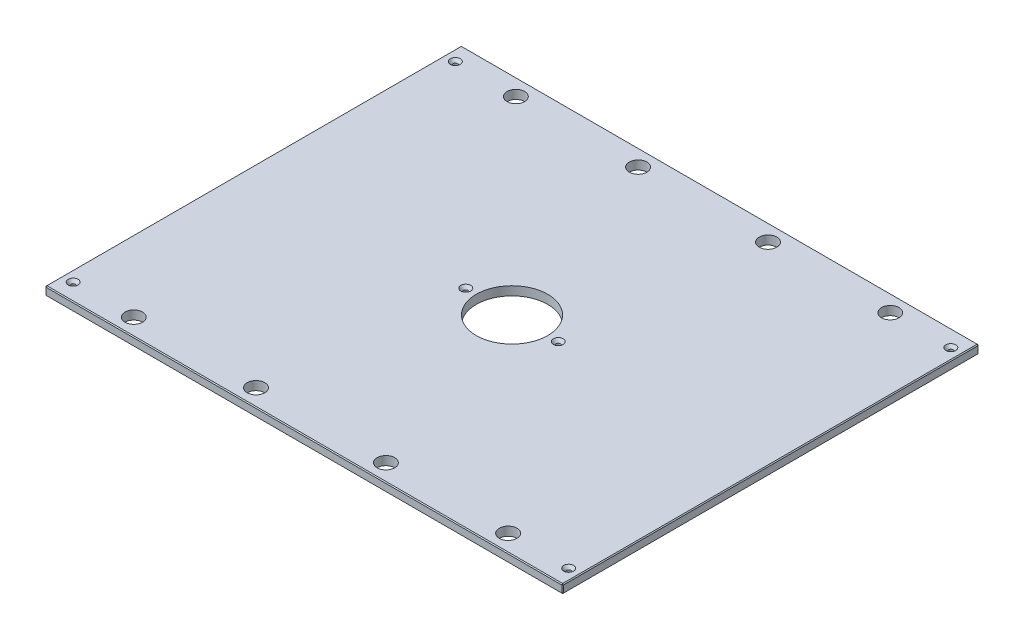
ISO-10303-21;
HEADER;
FILE_DESCRIPTION(('STEP AP214'),'2;1');
FILE_NAME('part.step','',(''),(''),'','','');
FILE_SCHEMA(('AUTOMOTIVE_DESIGN { 1 0 10303 214 1 1 1 1 }'));
ENDSEC;
DATA;
#1=APPLICATION_CONTEXT('core data for automotive mechanical design processes');
#2=APPLICATION_PROTOCOL_DEFINITION('international standard','automotive_design',2000,#1);
#3=PRODUCT_CONTEXT('',#1,'mechanical');
#4=PRODUCT('Part','Part','',(#3));
#5=PRODUCT_RELATED_PRODUCT_CATEGORY('part','',(#4));
#6=PRODUCT_DEFINITION_FORMATION('','',#4);
#7=PRODUCT_DEFINITION_CONTEXT('part definition',#1,'design');
#8=PRODUCT_DEFINITION('design','',#6,#7);
#9=PRODUCT_DEFINITION_SHAPE('','',#8);
#10=(LENGTH_UNIT() NAMED_UNIT(*) SI_UNIT(.MILLI.,.METRE.));
#11=(NAMED_UNIT(*) PLANE_ANGLE_UNIT() SI_UNIT($,.RADIAN.));
#12=(NAMED_UNIT(*) SI_UNIT($,.STERADIAN.) SOLID_ANGLE_UNIT());
#13=UNCERTAINTY_MEASURE_WITH_UNIT(LENGTH_MEASURE(1.E-05),#10,'distance_accuracy_value','');
#14=(GEOMETRIC_REPRESENTATION_CONTEXT(3) GLOBAL_UNCERTAINTY_ASSIGNED_CONTEXT((#13)) GLOBAL_UNIT_ASSIGNED_CONTEXT((#10,
#11,#12)) REPRESENTATION_CONTEXT('',''));
#15=CARTESIAN_POINT('',(0.,0.,0.));
#16=DIRECTION('',(0.,0.,1.));
#17=DIRECTION('',(1.,0.,0.));
#18=AXIS2_PLACEMENT_3D('',#15,#16,#17);
#19=CARTESIAN_POINT('',(-373.0625,12.7,-300.0375));
#20=DIRECTION('',(1.,0.,0.));
#21=DIRECTION('',(0.,0.,-1.));
#22=AXIS2_PLACEMENT_3D('',#19,#20,#21);
#23=PLANE('',#22);
#24=DIRECTION('',(0.,0.,-1.));
#25=VECTOR('',#24,1.);
#26=CARTESIAN_POINT('',(-373.0625,11.4299999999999,-300.0375));
#27=LINE('',#26,#25);
#28=CARTESIAN_POINT('',(-373.0625,11.4299999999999,298.7675));
#29=VERTEX_POINT('',#28);
#30=CARTESIAN_POINT('',(-373.0625,11.4299999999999,-298.7675));
#31=VERTEX_POINT('',#30);
#32=EDGE_CURVE('E135',#29,#31,#27,.T.);
#33=ORIENTED_EDGE('',*,*,#32,.T.);
#34=DIRECTION('',(0.,-1.,0.));
#35=VECTOR('',#34,1.);
#36=CARTESIAN_POINT('',(-373.0625,12.7,-298.7675));
#37=LINE('',#36,#35);
#38=CARTESIAN_POINT('',(-373.0625,1.2700000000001,-298.7675));
#39=VERTEX_POINT('',#38);
#40=EDGE_CURVE('E131',#31,#39,#37,.T.);
#41=ORIENTED_EDGE('',*,*,#40,.T.);
#42=DIRECTION('',(0.,0.,1.));
#43=VECTOR('',#42,1.);
#44=CARTESIAN_POINT('',(-373.0625,1.2700000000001,-300.0375));
#45=LINE('',#44,#43);
#46=CARTESIAN_POINT('',(-373.0625,1.2700000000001,298.7675));
#47=VERTEX_POINT('',#46);
#48=EDGE_CURVE('E126',#39,#47,#45,.T.);
#49=ORIENTED_EDGE('',*,*,#48,.T.);
#50=DIRECTION('',(0.,1.,0.));
#51=VECTOR('',#50,1.);
#52=CARTESIAN_POINT('',(-373.0625,12.7,298.7675));
#53=LINE('',#52,#51);
#54=EDGE_CURVE('E128',#47,#29,#53,.T.);
#55=ORIENTED_EDGE('',*,*,#54,.T.);
#56=EDGE_LOOP('',(#33,#41,#49,#55));
#57=FACE_BOUND('',#56,.T.);
#58=ADVANCED_FACE('F35',(#57),#23,.F.);
#59=CARTESIAN_POINT('',(-373.0625,12.7,300.0375));
#60=DIRECTION('',(0.,0.,-1.));
#61=DIRECTION('',(-1.,0.,0.));
#62=AXIS2_PLACEMENT_3D('',#59,#60,#61);
#63=PLANE('',#62);
#64=DIRECTION('',(1.,0.,0.));
#65=VECTOR('',#64,1.);
#66=CARTESIAN_POINT('',(-373.0625,1.2700000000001,300.0375));
#67=LINE('',#66,#65);
#68=CARTESIAN_POINT('',(-371.7925,1.2700000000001,300.0375));
#69=VERTEX_POINT('',#68);
#70=CARTESIAN_POINT('',(371.7925,1.2700000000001,300.0375));
#71=VERTEX_POINT('',#70);
#72=EDGE_CURVE('E58',#69,#71,#67,.T.);
#73=ORIENTED_EDGE('',*,*,#72,.T.);
#74=DIRECTION('',(0.,1.,0.));
#75=VECTOR('',#74,1.);
#76=CARTESIAN_POINT('',(371.7925,12.7,300.0375));
#77=LINE('',#76,#75);
#78=CARTESIAN_POINT('',(371.7925,11.4299999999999,300.0375));
#79=VERTEX_POINT('',#78);
#80=EDGE_CURVE('E11',#71,#79,#77,.T.);
#81=ORIENTED_EDGE('',*,*,#80,.T.);
#82=DIRECTION('',(-1.,0.,0.));
#83=VECTOR('',#82,1.);
#84=CARTESIAN_POINT('',(-373.0625,11.4299999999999,300.0375));
#85=LINE('',#84,#83);
#86=CARTESIAN_POINT('',(-371.7925,11.4299999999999,300.0375));
#87=VERTEX_POINT('',#86);
#88=EDGE_CURVE('E44',#79,#87,#85,.T.);
#89=ORIENTED_EDGE('',*,*,#88,.T.);
#90=DIRECTION('',(0.,-1.,0.));
#91=VECTOR('',#90,1.);
#92=CARTESIAN_POINT('',(-371.7925,12.7,300.0375));
#93=LINE('',#92,#91);
#94=EDGE_CURVE('E303',#87,#69,#93,.T.);
#95=ORIENTED_EDGE('',*,*,#94,.T.);
#96=EDGE_LOOP('',(#73,#81,#89,#95));
#97=FACE_BOUND('',#96,.T.);
#98=ADVANCED_FACE('F372',(#97),#63,.F.);
#99=CARTESIAN_POINT('',(373.0625,12.7,-300.0375));
#100=DIRECTION('',(-1.,0.,0.));
#101=DIRECTION('',(0.,0.,1.));
#102=AXIS2_PLACEMENT_3D('',#99,#100,#101);
#103=PLANE('',#102);
#104=DIRECTION('',(0.,0.,-1.));
#105=VECTOR('',#104,1.);
#106=CARTESIAN_POINT('',(373.0625,1.2700000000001,-300.0375));
#107=LINE('',#106,#105);
#108=CARTESIAN_POINT('',(373.0625,1.2700000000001,298.7675));
#109=VERTEX_POINT('',#108);
#110=CARTESIAN_POINT('',(373.0625,1.2700000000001,-298.7675));
#111=VERTEX_POINT('',#110);
#112=EDGE_CURVE('E298',#109,#111,#107,.T.);
#113=ORIENTED_EDGE('',*,*,#112,.T.);
#114=DIRECTION('',(0.,1.,0.));
#115=VECTOR('',#114,1.);
#116=CARTESIAN_POINT('',(373.0625,12.7,-298.7675));
#117=LINE('',#116,#115);
#118=CARTESIAN_POINT('',(373.0625,11.4299999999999,-298.7675));
#119=VERTEX_POINT('',#118);
#120=EDGE_CURVE('E300',#111,#119,#117,.T.);
#121=ORIENTED_EDGE('',*,*,#120,.T.);
#122=DIRECTION('',(0.,0.,1.));
#123=VECTOR('',#122,1.);
#124=CARTESIAN_POINT('',(373.0625,11.4299999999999,300.0375));
#125=LINE('',#124,#123);
#126=CARTESIAN_POINT('',(373.0625,11.4299999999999,298.7675));
#127=VERTEX_POINT('',#126);
#128=EDGE_CURVE('E296',#119,#127,#125,.T.);
#129=ORIENTED_EDGE('',*,*,#128,.T.);
#130=DIRECTION('',(0.,-1.,0.));
#131=VECTOR('',#130,1.);
#132=CARTESIAN_POINT('',(373.0625,12.7,298.7675));
#133=LINE('',#132,#131);
#134=EDGE_CURVE('E294',#127,#109,#133,.T.);
#135=ORIENTED_EDGE('',*,*,#134,.T.);
#136=EDGE_LOOP('',(#113,#121,#129,#135));
#137=FACE_BOUND('',#136,.T.);
#138=ADVANCED_FACE('F359',(#137),#103,.F.);
#139=CARTESIAN_POINT('',(-373.0625,12.7,-300.0375));
#140=DIRECTION('',(0.,0.,1.));
#141=DIRECTION('',(1.,0.,0.));
#142=AXIS2_PLACEMENT_3D('',#139,#140,#141);
#143=PLANE('',#142);
#144=DIRECTION('',(-1.,0.,0.));
#145=VECTOR('',#144,1.);
#146=CARTESIAN_POINT('',(-373.0625,1.2700000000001,-300.0375));
#147=LINE('',#146,#145);
#148=CARTESIAN_POINT('',(371.7925,1.2700000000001,-300.0375));
#149=VERTEX_POINT('',#148);
#150=CARTESIAN_POINT('',(-371.7925,1.2700000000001,-300.0375));
#151=VERTEX_POINT('',#150);
#152=EDGE_CURVE('E270',#149,#151,#147,.T.);
#153=ORIENTED_EDGE('',*,*,#152,.T.);
#154=DIRECTION('',(0.,1.,0.));
#155=VECTOR('',#154,1.);
#156=CARTESIAN_POINT('',(-371.7925,12.7,-300.0375));
#157=LINE('',#156,#155);
#158=CARTESIAN_POINT('',(-371.7925,11.4299999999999,-300.0375));
#159=VERTEX_POINT('',#158);
#160=EDGE_CURVE('E274',#151,#159,#157,.T.);
#161=ORIENTED_EDGE('',*,*,#160,.T.);
#162=DIRECTION('',(1.,0.,0.));
#163=VECTOR('',#162,1.);
#164=CARTESIAN_POINT('',(373.0625,11.4299999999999,-300.0375));
#165=LINE('',#164,#163);
#166=CARTESIAN_POINT('',(371.7925,11.4299999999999,-300.0375));
#167=VERTEX_POINT('',#166);
#168=EDGE_CURVE('E272',#159,#167,#165,.T.);
#169=ORIENTED_EDGE('',*,*,#168,.T.);
#170=DIRECTION('',(0.,-1.,0.));
#171=VECTOR('',#170,1.);
#172=CARTESIAN_POINT('',(371.7925,12.7,-300.0375));
#173=LINE('',#172,#171);
#174=EDGE_CURVE('E268',#167,#149,#173,.T.);
#175=ORIENTED_EDGE('',*,*,#174,.T.);
#176=EDGE_LOOP('',(#153,#161,#169,#175));
#177=FACE_BOUND('',#176,.T.);
#178=ADVANCED_FACE('F333',(#177),#143,.F.);
#179=CARTESIAN_POINT('',(0.,12.7,0.));
#180=DIRECTION('',(0.,1.,0.));
#181=DIRECTION('',(0.,0.,1.));
#182=AXIS2_PLACEMENT_3D('',#179,#180,#181);
#183=PLANE('',#182);
#184=CARTESIAN_POINT('',(357.1875,12.7,-275.42998));
#185=DIRECTION('',(0.,1.,0.));
#186=DIRECTION('',(0.,0.,1.));
#187=AXIS2_PLACEMENT_3D('',#184,#185,#186);
#188=CIRCLE('',#187,7.13740000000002);
#189=CARTESIAN_POINT('',(357.1875,12.7,-268.29258));
#190=VERTEX_POINT('',#189);
#191=EDGE_CURVE('E816',#190,#190,#188,.T.);
#192=ORIENTED_EDGE('',*,*,#191,.F.);
#193=EDGE_LOOP('',(#192));
#194=FACE_BOUND('',#193,.T.);
#195=CARTESIAN_POINT('',(357.1875,12.7,275.42998));
#196=DIRECTION('',(0.,1.,0.));
#197=DIRECTION('',(0.,0.,1.));
#198=AXIS2_PLACEMENT_3D('',#195,#196,#197);
#199=CIRCLE('',#198,7.13740000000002);
#200=CARTESIAN_POINT('',(357.1875,12.7,282.56738));
#201=VERTEX_POINT('',#200);
#202=EDGE_CURVE('E820',#201,#201,#199,.T.);
#203=ORIENTED_EDGE('',*,*,#202,.F.);
#204=EDGE_LOOP('',(#203));
#205=FACE_BOUND('',#204,.T.);
#206=CARTESIAN_POINT('',(-357.1875,12.7,275.42998));
#207=DIRECTION('',(0.,1.,0.));
#208=DIRECTION('',(0.,0.,1.));
#209=AXIS2_PLACEMENT_3D('',#206,#207,#208);
#210=CIRCLE('',#209,7.13740000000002);
#211=CARTESIAN_POINT('',(-357.1875,12.7,282.56738));
#212=VERTEX_POINT('',#211);
#213=EDGE_CURVE('E824',#212,#212,#210,.T.);
#214=ORIENTED_EDGE('',*,*,#213,.F.);
#215=EDGE_LOOP('',(#214));
#216=FACE_BOUND('',#215,.T.);
#217=CARTESIAN_POINT('',(-66.675,12.7,0.));
#218=DIRECTION('',(0.,1.,0.));
#219=DIRECTION('',(0.,0.,1.));
#220=AXIS2_PLACEMENT_3D('',#217,#218,#219);
#221=CIRCLE('',#220,7.1374);
#222=CARTESIAN_POINT('',(-66.675,12.7,7.1374));
#223=VERTEX_POINT('',#222);
#224=EDGE_CURVE('E828',#223,#223,#221,.T.);
#225=ORIENTED_EDGE('',*,*,#224,.F.);
#226=EDGE_LOOP('',(#225));
#227=FACE_BOUND('',#226,.T.);
#228=CARTESIAN_POINT('',(66.675,12.7,0.));
#229=DIRECTION('',(0.,1.,0.));
#230=DIRECTION('',(0.,0.,1.));
#231=AXIS2_PLACEMENT_3D('',#228,#229,#230);
#232=CIRCLE('',#231,7.1374);
#233=CARTESIAN_POINT('',(66.675,12.7,7.1374));
#234=VERTEX_POINT('',#233);
#235=EDGE_CURVE('E832',#234,#234,#232,.T.);
#236=ORIENTED_EDGE('',*,*,#235,.F.);
#237=EDGE_LOOP('',(#236));
#238=FACE_BOUND('',#237,.T.);
#239=CARTESIAN_POINT('',(-357.1875,12.7,-275.42998));
#240=DIRECTION('',(0.,1.,0.));
#241=DIRECTION('',(0.,0.,1.));
#242=AXIS2_PLACEMENT_3D('',#239,#240,#241);
#243=CIRCLE('',#242,7.13740000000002);
#244=CARTESIAN_POINT('',(-357.1875,12.7,-268.29258));
#245=VERTEX_POINT('',#244);
#246=EDGE_CURVE('E835',#245,#245,#243,.T.);
#247=ORIENTED_EDGE('',*,*,#246,.F.);
#248=EDGE_LOOP('',(#247));
#249=FACE_BOUND('',#248,.T.);
#250=DIRECTION('',(0.,0.,-1.));
#251=VECTOR('',#250,1.);
#252=CARTESIAN_POINT('',(371.7925,12.7,-300.0375));
#253=LINE('',#252,#251);
#254=CARTESIAN_POINT('',(371.7925,12.7,298.7675));
#255=VERTEX_POINT('',#254);
#256=CARTESIAN_POINT('',(371.7925,12.7,-298.7675));
#257=VERTEX_POINT('',#256);
#258=EDGE_CURVE('E281',#255,#257,#253,.T.);
#259=ORIENTED_EDGE('',*,*,#258,.T.);
#260=DIRECTION('',(-1.,0.,0.));
#261=VECTOR('',#260,1.);
#262=CARTESIAN_POINT('',(-373.0625,12.7,-298.7675));
#263=LINE('',#262,#261);
#264=CARTESIAN_POINT('',(-371.7925,12.7,-298.7675));
#265=VERTEX_POINT('',#264);
#266=EDGE_CURVE('E283',#257,#265,#263,.T.);
#267=ORIENTED_EDGE('',*,*,#266,.T.);
#268=DIRECTION('',(0.,0.,1.));
#269=VECTOR('',#268,1.);
#270=CARTESIAN_POINT('',(-371.7925,12.7,300.0375));
#271=LINE('',#270,#269);
#272=CARTESIAN_POINT('',(-371.7925,12.7,298.7675));
#273=VERTEX_POINT('',#272);
#274=EDGE_CURVE('E279',#265,#273,#271,.T.);
#275=ORIENTED_EDGE('',*,*,#274,.T.);
#276=DIRECTION('',(1.,0.,0.));
#277=VECTOR('',#276,1.);
#278=CARTESIAN_POINT('',(373.0625,12.7,298.7675));
#279=LINE('',#278,#277);
#280=EDGE_CURVE('E277',#273,#255,#279,.T.);
#281=ORIENTED_EDGE('',*,*,#280,.T.);
#282=EDGE_LOOP('',(#259,#267,#275,#281));
#283=FACE_BOUND('',#282,.T.);
#284=CARTESIAN_POINT('',(269.875,12.7,-275.42998));
#285=DIRECTION('',(0.,1.,0.));
#286=DIRECTION('',(0.,0.,1.));
#287=AXIS2_PLACEMENT_3D('',#284,#285,#286);
#288=CIRCLE('',#287,12.7);
#289=CARTESIAN_POINT('',(269.875,12.7,-262.72998));
#290=VERTEX_POINT('',#289);
#291=EDGE_CURVE('E204',#290,#290,#288,.T.);
#292=ORIENTED_EDGE('',*,*,#291,.F.);
#293=EDGE_LOOP('',(#292));
#294=FACE_BOUND('',#293,.T.);
#295=CARTESIAN_POINT('',(-269.875,12.7,-275.42998));
#296=DIRECTION('',(0.,1.,0.));
#297=DIRECTION('',(0.,0.,1.));
#298=AXIS2_PLACEMENT_3D('',#295,#296,#297);
#299=CIRCLE('',#298,12.7);
#300=CARTESIAN_POINT('',(-269.875,12.7,-262.72998));
#301=VERTEX_POINT('',#300);
#302=EDGE_CURVE('E214',#301,#301,#299,.T.);
#303=ORIENTED_EDGE('',*,*,#302,.F.);
#304=EDGE_LOOP('',(#303));
#305=FACE_BOUND('',#304,.T.);
#306=CARTESIAN_POINT('',(269.875,12.7,275.42998));
#307=DIRECTION('',(0.,1.,0.));
#308=DIRECTION('',(0.,0.,1.));
#309=AXIS2_PLACEMENT_3D('',#306,#307,#308);
#310=CIRCLE('',#309,12.7);
#311=CARTESIAN_POINT('',(269.875,12.7,288.12998));
#312=VERTEX_POINT('',#311);
#313=EDGE_CURVE('E225',#312,#312,#310,.T.);
#314=ORIENTED_EDGE('',*,*,#313,.F.);
#315=EDGE_LOOP('',(#314));
#316=FACE_BOUND('',#315,.T.);
#317=CARTESIAN_POINT('',(-269.875,12.7,275.42998));
#318=DIRECTION('',(0.,1.,0.));
#319=DIRECTION('',(0.,0.,1.));
#320=AXIS2_PLACEMENT_3D('',#317,#318,#319);
#321=CIRCLE('',#320,12.7);
#322=CARTESIAN_POINT('',(-269.875,12.7,288.12998));
#323=VERTEX_POINT('',#322);
#324=EDGE_CURVE('E231',#323,#323,#321,.T.);
#325=ORIENTED_EDGE('',*,*,#324,.F.);
#326=EDGE_LOOP('',(#325));
#327=FACE_BOUND('',#326,.T.);
#328=CARTESIAN_POINT('',(-93.6625,12.7,-275.42998));
#329=DIRECTION('',(0.,1.,0.));
#330=DIRECTION('',(0.,0.,1.));
#331=AXIS2_PLACEMENT_3D('',#328,#329,#330);
#332=CIRCLE('',#331,12.7);
#333=CARTESIAN_POINT('',(-93.6625,12.7,-262.72998));
#334=VERTEX_POINT('',#333);
#335=EDGE_CURVE('E237',#334,#334,#332,.T.);
#336=ORIENTED_EDGE('',*,*,#335,.F.);
#337=EDGE_LOOP('',(#336));
#338=FACE_BOUND('',#337,.T.);
#339=CARTESIAN_POINT('',(93.6625,12.7,-275.42998));
#340=DIRECTION('',(0.,1.,0.));
#341=DIRECTION('',(0.,0.,1.));
#342=AXIS2_PLACEMENT_3D('',#339,#340,#341);
#343=CIRCLE('',#342,12.7);
#344=CARTESIAN_POINT('',(93.6625,12.7,-262.72998));
#345=VERTEX_POINT('',#344);
#346=EDGE_CURVE('E243',#345,#345,#343,.T.);
#347=ORIENTED_EDGE('',*,*,#346,.F.);
#348=EDGE_LOOP('',(#347));
#349=FACE_BOUND('',#348,.T.);
#350=CARTESIAN_POINT('',(93.6625,12.7,275.42998));
#351=DIRECTION('',(0.,1.,0.));
#352=DIRECTION('',(0.,0.,1.));
#353=AXIS2_PLACEMENT_3D('',#350,#351,#352);
#354=CIRCLE('',#353,12.7);
#355=CARTESIAN_POINT('',(93.6625,12.7,288.12998));
#356=VERTEX_POINT('',#355);
#357=EDGE_CURVE('E249',#356,#356,#354,.T.);
#358=ORIENTED_EDGE('',*,*,#357,.F.);
#359=EDGE_LOOP('',(#358));
#360=FACE_BOUND('',#359,.T.);
#361=CARTESIAN_POINT('',(-93.6625,12.7,275.42998));
#362=DIRECTION('',(0.,1.,0.));
#363=DIRECTION('',(0.,0.,1.));
#364=AXIS2_PLACEMENT_3D('',#361,#362,#363);
#365=CIRCLE('',#364,12.7);
#366=CARTESIAN_POINT('',(-93.6625,12.7,288.12998));
#367=VERTEX_POINT('',#366);
#368=EDGE_CURVE('E255',#367,#367,#365,.T.);
#369=ORIENTED_EDGE('',*,*,#368,.F.);
#370=EDGE_LOOP('',(#369));
#371=FACE_BOUND('',#370,.T.);
#372=CARTESIAN_POINT('',(0.,12.7,0.));
#373=DIRECTION('',(0.,1.,0.));
#374=DIRECTION('',(0.,0.,1.));
#375=AXIS2_PLACEMENT_3D('',#372,#373,#374);
#376=CIRCLE('',#375,51.562);
#377=CARTESIAN_POINT('',(0.,12.7,51.562));
#378=VERTEX_POINT('',#377);
#379=EDGE_CURVE('E261',#378,#378,#376,.T.);
#380=ORIENTED_EDGE('',*,*,#379,.F.);
#381=EDGE_LOOP('',(#380));
#382=FACE_BOUND('',#381,.T.);
#383=ADVANCED_FACE('F381',(#194,#205,#216,#227,#238,#249,#283,#294,#305,#316,#327,#338,#349,
#360,#371,#382),#183,.T.);
#384=CARTESIAN_POINT('',(0.,0.,0.));
#385=DIRECTION('',(0.,1.,0.));
#386=DIRECTION('',(0.,0.,1.));
#387=AXIS2_PLACEMENT_3D('',#384,#385,#386);
#388=PLANE('',#387);
#389=CARTESIAN_POINT('',(357.1875,0.,-275.42998));
#390=DIRECTION('',(0.,1.,0.));
#391=DIRECTION('',(0.,0.,1.));
#392=AXIS2_PLACEMENT_3D('',#389,#390,#391);
#393=CIRCLE('',#392,3.3782);
#394=CARTESIAN_POINT('',(357.1875,0.,-272.05178));
#395=VERTEX_POINT('',#394);
#396=EDGE_CURVE('E869',#395,#395,#393,.T.);
#397=ORIENTED_EDGE('',*,*,#396,.T.);
#398=EDGE_LOOP('',(#397));
#399=FACE_BOUND('',#398,.T.);
#400=CARTESIAN_POINT('',(357.1875,0.,275.42998));
#401=DIRECTION('',(0.,1.,0.));
#402=DIRECTION('',(0.,0.,1.));
#403=AXIS2_PLACEMENT_3D('',#400,#401,#402);
#404=CIRCLE('',#403,3.3782);
#405=CARTESIAN_POINT('',(357.1875,0.,278.80818));
#406=VERTEX_POINT('',#405);
#407=EDGE_CURVE('E862',#406,#406,#404,.T.);
#408=ORIENTED_EDGE('',*,*,#407,.T.);
#409=EDGE_LOOP('',(#408));
#410=FACE_BOUND('',#409,.T.);
#411=CARTESIAN_POINT('',(-357.1875,0.,275.42998));
#412=DIRECTION('',(0.,1.,0.));
#413=DIRECTION('',(0.,0.,1.));
#414=AXIS2_PLACEMENT_3D('',#411,#412,#413);
#415=CIRCLE('',#414,3.3782);
#416=CARTESIAN_POINT('',(-357.1875,0.,278.80818));
#417=VERTEX_POINT('',#416);
#418=EDGE_CURVE('E855',#417,#417,#415,.T.);
#419=ORIENTED_EDGE('',*,*,#418,.T.);
#420=EDGE_LOOP('',(#419));
#421=FACE_BOUND('',#420,.T.);
#422=CARTESIAN_POINT('',(-66.675,0.,0.));
#423=DIRECTION('',(0.,1.,0.));
#424=DIRECTION('',(0.,0.,1.));
#425=AXIS2_PLACEMENT_3D('',#422,#423,#424);
#426=CIRCLE('',#425,3.3782);
#427=CARTESIAN_POINT('',(-66.675,0.,3.3782));
#428=VERTEX_POINT('',#427);
#429=EDGE_CURVE('E848',#428,#428,#426,.T.);
#430=ORIENTED_EDGE('',*,*,#429,.T.);
#431=EDGE_LOOP('',(#430));
#432=FACE_BOUND('',#431,.T.);
#433=CARTESIAN_POINT('',(66.675,0.,0.));
#434=DIRECTION('',(0.,1.,0.));
#435=DIRECTION('',(0.,0.,1.));
#436=AXIS2_PLACEMENT_3D('',#433,#434,#435);
#437=CIRCLE('',#436,3.3782);
#438=CARTESIAN_POINT('',(66.675,0.,3.3782));
#439=VERTEX_POINT('',#438);
#440=EDGE_CURVE('E838',#439,#439,#437,.T.);
#441=ORIENTED_EDGE('',*,*,#440,.T.);
#442=EDGE_LOOP('',(#441));
#443=FACE_BOUND('',#442,.T.);
#444=CARTESIAN_POINT('',(-357.1875,0.,-275.42998));
#445=DIRECTION('',(0.,1.,0.));
#446=DIRECTION('',(0.,0.,1.));
#447=AXIS2_PLACEMENT_3D('',#444,#445,#446);
#448=CIRCLE('',#447,3.3782);
#449=CARTESIAN_POINT('',(-357.1875,0.,-272.05178));
#450=VERTEX_POINT('',#449);
#451=EDGE_CURVE('E217',#450,#450,#448,.T.);
#452=ORIENTED_EDGE('',*,*,#451,.T.);
#453=EDGE_LOOP('',(#452));
#454=FACE_BOUND('',#453,.T.);
#455=DIRECTION('',(0.,0.,-1.));
#456=VECTOR('',#455,1.);
#457=CARTESIAN_POINT('',(-371.7925,0.,0.));
#458=LINE('',#457,#456);
#459=CARTESIAN_POINT('',(-371.7925,0.,298.7675));
#460=VERTEX_POINT('',#459);
#461=CARTESIAN_POINT('',(-371.7925,0.,-298.7675));
#462=VERTEX_POINT('',#461);
#463=EDGE_CURVE('E158',#460,#462,#458,.T.);
#464=ORIENTED_EDGE('',*,*,#463,.T.);
#465=DIRECTION('',(1.,0.,0.));
#466=VECTOR('',#465,1.);
#467=CARTESIAN_POINT('',(0.,0.,-298.7675));
#468=LINE('',#467,#466);
#469=CARTESIAN_POINT('',(371.7925,0.,-298.7675));
#470=VERTEX_POINT('',#469);
#471=EDGE_CURVE('E291',#462,#470,#468,.T.);
#472=ORIENTED_EDGE('',*,*,#471,.T.);
#473=DIRECTION('',(0.,0.,1.));
#474=VECTOR('',#473,1.);
#475=CARTESIAN_POINT('',(371.7925,0.,0.));
#476=LINE('',#475,#474);
#477=CARTESIAN_POINT('',(371.7925,0.,298.7675));
#478=VERTEX_POINT('',#477);
#479=EDGE_CURVE('E289',#470,#478,#476,.T.);
#480=ORIENTED_EDGE('',*,*,#479,.T.);
#481=DIRECTION('',(-1.,0.,0.));
#482=VECTOR('',#481,1.);
#483=CARTESIAN_POINT('',(0.,0.,298.7675));
#484=LINE('',#483,#482);
#485=EDGE_CURVE('E286',#478,#460,#484,.T.);
#486=ORIENTED_EDGE('',*,*,#485,.T.);
#487=EDGE_LOOP('',(#464,#472,#480,#486));
#488=FACE_BOUND('',#487,.T.);
#489=CARTESIAN_POINT('',(269.875,0.,-275.42998));
#490=DIRECTION('',(0.,1.,0.));
#491=DIRECTION('',(0.,0.,1.));
#492=AXIS2_PLACEMENT_3D('',#489,#490,#491);
#493=CIRCLE('',#492,12.7);
#494=CARTESIAN_POINT('',(269.875,0.,-262.72998));
#495=VERTEX_POINT('',#494);
#496=EDGE_CURVE('E209',#495,#495,#493,.T.);
#497=ORIENTED_EDGE('',*,*,#496,.T.);
#498=EDGE_LOOP('',(#497));
#499=FACE_BOUND('',#498,.T.);
#500=CARTESIAN_POINT('',(-269.875,0.,-275.42998));
#501=DIRECTION('',(0.,1.,0.));
#502=DIRECTION('',(0.,0.,1.));
#503=AXIS2_PLACEMENT_3D('',#500,#501,#502);
#504=CIRCLE('',#503,12.7);
#505=CARTESIAN_POINT('',(-269.875,0.,-262.72998));
#506=VERTEX_POINT('',#505);
#507=EDGE_CURVE('E222',#506,#506,#504,.T.);
#508=ORIENTED_EDGE('',*,*,#507,.T.);
#509=EDGE_LOOP('',(#508));
#510=FACE_BOUND('',#509,.T.);
#511=CARTESIAN_POINT('',(269.875,0.,275.42998));
#512=DIRECTION('',(0.,1.,0.));
#513=DIRECTION('',(0.,0.,1.));
#514=AXIS2_PLACEMENT_3D('',#511,#512,#513);
#515=CIRCLE('',#514,12.7);
#516=CARTESIAN_POINT('',(269.875,0.,288.12998));
#517=VERTEX_POINT('',#516);
#518=EDGE_CURVE('E228',#517,#517,#515,.T.);
#519=ORIENTED_EDGE('',*,*,#518,.T.);
#520=EDGE_LOOP('',(#519));
#521=FACE_BOUND('',#520,.T.);
#522=CARTESIAN_POINT('',(-269.875,0.,275.42998));
#523=DIRECTION('',(0.,1.,0.));
#524=DIRECTION('',(0.,0.,1.));
#525=AXIS2_PLACEMENT_3D('',#522,#523,#524);
#526=CIRCLE('',#525,12.7);
#527=CARTESIAN_POINT('',(-269.875,0.,288.12998));
#528=VERTEX_POINT('',#527);
#529=EDGE_CURVE('E234',#528,#528,#526,.T.);
#530=ORIENTED_EDGE('',*,*,#529,.T.);
#531=EDGE_LOOP('',(#530));
#532=FACE_BOUND('',#531,.T.);
#533=CARTESIAN_POINT('',(-93.6625,0.,-275.42998));
#534=DIRECTION('',(0.,1.,0.));
#535=DIRECTION('',(0.,0.,1.));
#536=AXIS2_PLACEMENT_3D('',#533,#534,#535);
#537=CIRCLE('',#536,12.7);
#538=CARTESIAN_POINT('',(-93.6625,0.,-262.72998));
#539=VERTEX_POINT('',#538);
#540=EDGE_CURVE('E240',#539,#539,#537,.T.);
#541=ORIENTED_EDGE('',*,*,#540,.T.);
#542=EDGE_LOOP('',(#541));
#543=FACE_BOUND('',#542,.T.);
#544=CARTESIAN_POINT('',(93.6625,0.,-275.42998));
#545=DIRECTION('',(0.,1.,0.));
#546=DIRECTION('',(0.,0.,1.));
#547=AXIS2_PLACEMENT_3D('',#544,#545,#546);
#548=CIRCLE('',#547,12.7);
#549=CARTESIAN_POINT('',(93.6625,0.,-262.72998));
#550=VERTEX_POINT('',#549);
#551=EDGE_CURVE('E246',#550,#550,#548,.T.);
#552=ORIENTED_EDGE('',*,*,#551,.T.);
#553=EDGE_LOOP('',(#552));
#554=FACE_BOUND('',#553,.T.);
#555=CARTESIAN_POINT('',(93.6625,0.,275.42998));
#556=DIRECTION('',(0.,1.,0.));
#557=DIRECTION('',(0.,0.,1.));
#558=AXIS2_PLACEMENT_3D('',#555,#556,#557);
#559=CIRCLE('',#558,12.7);
#560=CARTESIAN_POINT('',(93.6625,0.,288.12998));
#561=VERTEX_POINT('',#560);
#562=EDGE_CURVE('E252',#561,#561,#559,.T.);
#563=ORIENTED_EDGE('',*,*,#562,.T.);
#564=EDGE_LOOP('',(#563));
#565=FACE_BOUND('',#564,.T.);
#566=CARTESIAN_POINT('',(-93.6625,0.,275.42998));
#567=DIRECTION('',(0.,1.,0.));
#568=DIRECTION('',(0.,0.,1.));
#569=AXIS2_PLACEMENT_3D('',#566,#567,#568);
#570=CIRCLE('',#569,12.7);
#571=CARTESIAN_POINT('',(-93.6625,0.,288.12998));
#572=VERTEX_POINT('',#571);
#573=EDGE_CURVE('E258',#572,#572,#570,.T.);
#574=ORIENTED_EDGE('',*,*,#573,.T.);
#575=EDGE_LOOP('',(#574));
#576=FACE_BOUND('',#575,.T.);
#577=CARTESIAN_POINT('',(0.,0.,0.));
#578=DIRECTION('',(0.,1.,0.));
#579=DIRECTION('',(0.,0.,1.));
#580=AXIS2_PLACEMENT_3D('',#577,#578,#579);
#581=CIRCLE('',#580,51.562);
#582=CARTESIAN_POINT('',(0.,0.,51.562));
#583=VERTEX_POINT('',#582);
#584=EDGE_CURVE('E147',#583,#583,#581,.T.);
#585=ORIENTED_EDGE('',*,*,#584,.T.);
#586=EDGE_LOOP('',(#585));
#587=FACE_BOUND('',#586,.T.);
#588=ADVANCED_FACE('F346',(#399,#410,#421,#432,#443,#454,#488,#499,#510,#521,#532,#543,#554,
#565,#576,#587),#388,.F.);
#589=CARTESIAN_POINT('',(0.,0.,0.));
#590=DIRECTION('',(0.,1.,0.));
#591=DIRECTION('',(0.,0.,1.));
#592=AXIS2_PLACEMENT_3D('',#589,#590,#591);
#593=CYLINDRICAL_SURFACE('',#592,51.562);
#594=ORIENTED_EDGE('',*,*,#584,.F.);
#595=EDGE_LOOP('',(#594));
#596=FACE_BOUND('',#595,.T.);
#597=ORIENTED_EDGE('',*,*,#379,.T.);
#598=EDGE_LOOP('',(#597));
#599=FACE_BOUND('',#598,.T.);
#600=ADVANCED_FACE('F751',(#596,#599),#593,.F.);
#601=CARTESIAN_POINT('',(-93.6625,12.7,275.42998));
#602=DIRECTION('',(0.,1.,0.));
#603=DIRECTION('',(0.,0.,1.));
#604=AXIS2_PLACEMENT_3D('',#601,#602,#603);
#605=CYLINDRICAL_SURFACE('',#604,12.7);
#606=ORIENTED_EDGE('',*,*,#573,.F.);
#607=EDGE_LOOP('',(#606));
#608=FACE_BOUND('',#607,.T.);
#609=ORIENTED_EDGE('',*,*,#368,.T.);
#610=EDGE_LOOP('',(#609));
#611=FACE_BOUND('',#610,.T.);
#612=ADVANCED_FACE('F742',(#608,#611),#605,.F.);
#613=CARTESIAN_POINT('',(93.6625,12.7,275.42998));
#614=DIRECTION('',(0.,1.,0.));
#615=DIRECTION('',(0.,0.,1.));
#616=AXIS2_PLACEMENT_3D('',#613,#614,#615);
#617=CYLINDRICAL_SURFACE('',#616,12.7);
#618=ORIENTED_EDGE('',*,*,#562,.F.);
#619=EDGE_LOOP('',(#618));
#620=FACE_BOUND('',#619,.T.);
#621=ORIENTED_EDGE('',*,*,#357,.T.);
#622=EDGE_LOOP('',(#621));
#623=FACE_BOUND('',#622,.T.);
#624=ADVANCED_FACE('F733',(#620,#623),#617,.F.);
#625=CARTESIAN_POINT('',(93.6625,12.7,-275.42998));
#626=DIRECTION('',(0.,1.,0.));
#627=DIRECTION('',(0.,0.,1.));
#628=AXIS2_PLACEMENT_3D('',#625,#626,#627);
#629=CYLINDRICAL_SURFACE('',#628,12.7);
#630=ORIENTED_EDGE('',*,*,#551,.F.);
#631=EDGE_LOOP('',(#630));
#632=FACE_BOUND('',#631,.T.);
#633=ORIENTED_EDGE('',*,*,#346,.T.);
#634=EDGE_LOOP('',(#633));
#635=FACE_BOUND('',#634,.T.);
#636=ADVANCED_FACE('F724',(#632,#635),#629,.F.);
#637=CARTESIAN_POINT('',(-93.6625,12.7,-275.42998));
#638=DIRECTION('',(0.,1.,0.));
#639=DIRECTION('',(0.,0.,1.));
#640=AXIS2_PLACEMENT_3D('',#637,#638,#639);
#641=CYLINDRICAL_SURFACE('',#640,12.7);
#642=ORIENTED_EDGE('',*,*,#540,.F.);
#643=EDGE_LOOP('',(#642));
#644=FACE_BOUND('',#643,.T.);
#645=ORIENTED_EDGE('',*,*,#335,.T.);
#646=EDGE_LOOP('',(#645));
#647=FACE_BOUND('',#646,.T.);
#648=ADVANCED_FACE('F715',(#644,#647),#641,.F.);
#649=CARTESIAN_POINT('',(-269.875,12.7,275.42998));
#650=DIRECTION('',(0.,1.,0.));
#651=DIRECTION('',(0.,0.,1.));
#652=AXIS2_PLACEMENT_3D('',#649,#650,#651);
#653=CYLINDRICAL_SURFACE('',#652,12.7);
#654=ORIENTED_EDGE('',*,*,#529,.F.);
#655=EDGE_LOOP('',(#654));
#656=FACE_BOUND('',#655,.T.);
#657=ORIENTED_EDGE('',*,*,#324,.T.);
#658=EDGE_LOOP('',(#657));
#659=FACE_BOUND('',#658,.T.);
#660=ADVANCED_FACE('F706',(#656,#659),#653,.F.);
#661=CARTESIAN_POINT('',(269.875,12.7,275.42998));
#662=DIRECTION('',(0.,1.,0.));
#663=DIRECTION('',(0.,0.,1.));
#664=AXIS2_PLACEMENT_3D('',#661,#662,#663);
#665=CYLINDRICAL_SURFACE('',#664,12.7);
#666=ORIENTED_EDGE('',*,*,#518,.F.);
#667=EDGE_LOOP('',(#666));
#668=FACE_BOUND('',#667,.T.);
#669=ORIENTED_EDGE('',*,*,#313,.T.);
#670=EDGE_LOOP('',(#669));
#671=FACE_BOUND('',#670,.T.);
#672=ADVANCED_FACE('F697',(#668,#671),#665,.F.);
#673=CARTESIAN_POINT('',(-269.875,12.7,-275.42998));
#674=DIRECTION('',(0.,1.,0.));
#675=DIRECTION('',(0.,0.,1.));
#676=AXIS2_PLACEMENT_3D('',#673,#674,#675);
#677=CYLINDRICAL_SURFACE('',#676,12.7);
#678=ORIENTED_EDGE('',*,*,#507,.F.);
#679=EDGE_LOOP('',(#678));
#680=FACE_BOUND('',#679,.T.);
#681=ORIENTED_EDGE('',*,*,#302,.T.);
#682=EDGE_LOOP('',(#681));
#683=FACE_BOUND('',#682,.T.);
#684=ADVANCED_FACE('F687',(#680,#683),#677,.F.);
#685=CARTESIAN_POINT('',(269.875,12.7,-275.42998));
#686=DIRECTION('',(0.,1.,0.));
#687=DIRECTION('',(0.,0.,1.));
#688=AXIS2_PLACEMENT_3D('',#685,#686,#687);
#689=CYLINDRICAL_SURFACE('',#688,12.7);
#690=ORIENTED_EDGE('',*,*,#496,.F.);
#691=EDGE_LOOP('',(#690));
#692=FACE_BOUND('',#691,.T.);
#693=ORIENTED_EDGE('',*,*,#291,.T.);
#694=EDGE_LOOP('',(#693));
#695=FACE_BOUND('',#694,.T.);
#696=ADVANCED_FACE('F390',(#692,#695),#689,.F.);
#697=CARTESIAN_POINT('',(373.0625,12.7,298.7675));
#698=DIRECTION('',(-0.707106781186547,0.,-0.707106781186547));
#699=DIRECTION('',(0.,-1.,0.));
#700=AXIS2_PLACEMENT_3D('',#697,#698,#699);
#701=PLANE('',#700);
#702=DIRECTION('',(-0.707106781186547,0.,0.707106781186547));
#703=VECTOR('',#702,1.);
#704=CARTESIAN_POINT('',(373.0625,11.4299999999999,298.7675));
#705=LINE('',#704,#703);
#706=EDGE_CURVE('E39',#79,#127,#705,.F.);
#707=ORIENTED_EDGE('',*,*,#706,.F.);
#708=ORIENTED_EDGE('',*,*,#80,.F.);
#709=DIRECTION('',(0.707106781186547,0.,-0.707106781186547));
#710=VECTOR('',#709,1.);
#711=CARTESIAN_POINT('',(372.4275,1.2700000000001,299.4025));
#712=LINE('',#711,#710);
#713=EDGE_CURVE('E197',#109,#71,#712,.F.);
#714=ORIENTED_EDGE('',*,*,#713,.F.);
#715=ORIENTED_EDGE('',*,*,#134,.F.);
#716=EDGE_LOOP('',(#707,#708,#714,#715));
#717=FACE_BOUND('',#716,.T.);
#718=ADVANCED_FACE('F37',(#717),#701,.F.);
#719=CARTESIAN_POINT('',(373.0625,11.4299999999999,298.7675));
#720=DIRECTION('',(0.577350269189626,0.577350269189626,0.577350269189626));
#721=DIRECTION('',(0.707106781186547,0.,-0.707106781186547));
#722=AXIS2_PLACEMENT_3D('',#719,#720,#721);
#723=PLANE('',#722);
#724=DIRECTION('',(0.,-0.707106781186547,0.707106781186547));
#725=VECTOR('',#724,1.);
#726=CARTESIAN_POINT('',(371.7925,12.0649999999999,299.4025));
#727=LINE('',#726,#725);
#728=EDGE_CURVE('E193',#79,#255,#727,.F.);
#729=ORIENTED_EDGE('',*,*,#728,.F.);
#730=ORIENTED_EDGE('',*,*,#706,.T.);
#731=DIRECTION('',(-0.707106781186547,0.707106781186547,0.));
#732=VECTOR('',#731,1.);
#733=CARTESIAN_POINT('',(373.0625,11.4299999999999,298.7675));
#734=LINE('',#733,#732);
#735=EDGE_CURVE('E195',#255,#127,#734,.F.);
#736=ORIENTED_EDGE('',*,*,#735,.F.);
#737=EDGE_LOOP('',(#729,#730,#736));
#738=FACE_BOUND('',#737,.T.);
#739=ADVANCED_FACE('F383',(#738),#723,.T.);
#740=CARTESIAN_POINT('',(371.7925,0.,298.7675));
#741=DIRECTION('',(0.577350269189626,-0.577350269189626,0.577350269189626));
#742=DIRECTION('',(0.707106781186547,0.,-0.707106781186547));
#743=AXIS2_PLACEMENT_3D('',#740,#741,#742);
#744=PLANE('',#743);
#745=DIRECTION('',(-0.707106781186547,-0.707106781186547,0.));
#746=VECTOR('',#745,1.);
#747=CARTESIAN_POINT('',(371.7925,0.,298.7675));
#748=LINE('',#747,#746);
#749=EDGE_CURVE('E187',#109,#478,#748,.T.);
#750=ORIENTED_EDGE('',*,*,#749,.F.);
#751=ORIENTED_EDGE('',*,*,#713,.T.);
#752=DIRECTION('',(0.,0.707106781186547,0.707106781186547));
#753=VECTOR('',#752,1.);
#754=CARTESIAN_POINT('',(371.7925,0.,298.7675));
#755=LINE('',#754,#753);
#756=EDGE_CURVE('E190',#478,#71,#755,.T.);
#757=ORIENTED_EDGE('',*,*,#756,.F.);
#758=EDGE_LOOP('',(#750,#751,#757));
#759=FACE_BOUND('',#758,.T.);
#760=ADVANCED_FACE('F352',(#759),#744,.T.);
#761=CARTESIAN_POINT('',(371.7925,12.7,0.));
#762=DIRECTION('',(0.707106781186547,0.707106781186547,0.));
#763=DIRECTION('',(0.,0.,1.));
#764=AXIS2_PLACEMENT_3D('',#761,#762,#763);
#765=PLANE('',#764);
#766=ORIENTED_EDGE('',*,*,#735,.T.);
#767=ORIENTED_EDGE('',*,*,#128,.F.);
#768=DIRECTION('',(0.707106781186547,-0.707106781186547,0.));
#769=VECTOR('',#768,1.);
#770=CARTESIAN_POINT('',(372.4275,12.0649999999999,-298.7675));
#771=LINE('',#770,#769);
#772=EDGE_CURVE('E182',#257,#119,#771,.T.);
#773=ORIENTED_EDGE('',*,*,#772,.F.);
#774=ORIENTED_EDGE('',*,*,#258,.F.);
#775=EDGE_LOOP('',(#766,#767,#773,#774));
#776=FACE_BOUND('',#775,.T.);
#777=ADVANCED_FACE('F369',(#776),#765,.T.);
#778=CARTESIAN_POINT('',(0.,12.7,298.7675));
#779=DIRECTION('',(0.,0.707106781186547,0.707106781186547));
#780=DIRECTION('',(-1.,0.,0.));
#781=AXIS2_PLACEMENT_3D('',#778,#779,#780);
#782=PLANE('',#781);
#783=ORIENTED_EDGE('',*,*,#728,.T.);
#784=ORIENTED_EDGE('',*,*,#280,.F.);
#785=DIRECTION('',(0.,0.707106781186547,-0.707106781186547));
#786=VECTOR('',#785,1.);
#787=CARTESIAN_POINT('',(-371.7925,12.7,298.7675));
#788=LINE('',#787,#786);
#789=EDGE_CURVE('E179',#87,#273,#788,.T.);
#790=ORIENTED_EDGE('',*,*,#789,.F.);
#791=ORIENTED_EDGE('',*,*,#88,.F.);
#792=EDGE_LOOP('',(#783,#784,#790,#791));
#793=FACE_BOUND('',#792,.T.);
#794=ADVANCED_FACE('F374',(#793),#782,.T.);
#795=CARTESIAN_POINT('',(-371.7925,12.7,300.0375));
#796=DIRECTION('',(0.707106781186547,0.,-0.707106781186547));
#797=DIRECTION('',(0.,-1.,0.));
#798=AXIS2_PLACEMENT_3D('',#795,#796,#797);
#799=PLANE('',#798);
#800=DIRECTION('',(0.707106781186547,0.,0.707106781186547));
#801=VECTOR('',#800,1.);
#802=CARTESIAN_POINT('',(-373.0625,1.2700000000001,298.7675));
#803=LINE('',#802,#801);
#804=EDGE_CURVE('E142',#69,#47,#803,.F.);
#805=ORIENTED_EDGE('',*,*,#804,.F.);
#806=ORIENTED_EDGE('',*,*,#94,.F.);
#807=DIRECTION('',(-0.707106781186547,0.,-0.707106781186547));
#808=VECTOR('',#807,1.);
#809=CARTESIAN_POINT('',(-372.4275,11.4299999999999,299.4025));
#810=LINE('',#809,#808);
#811=EDGE_CURVE('E145',#29,#87,#810,.F.);
#812=ORIENTED_EDGE('',*,*,#811,.F.);
#813=ORIENTED_EDGE('',*,*,#54,.F.);
#814=EDGE_LOOP('',(#805,#806,#812,#813));
#815=FACE_BOUND('',#814,.T.);
#816=ADVANCED_FACE('F140',(#815),#799,.F.);
#817=CARTESIAN_POINT('',(-373.0625,1.2700000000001,300.0375));
#818=DIRECTION('',(0.,0.707106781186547,-0.707106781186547));
#819=DIRECTION('',(1.,0.,0.));
#820=AXIS2_PLACEMENT_3D('',#817,#818,#819);
#821=PLANE('',#820);
#822=ORIENTED_EDGE('',*,*,#756,.T.);
#823=ORIENTED_EDGE('',*,*,#72,.F.);
#824=DIRECTION('',(0.,-0.707106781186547,-0.707106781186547));
#825=VECTOR('',#824,1.);
#826=CARTESIAN_POINT('',(-371.7925,0.635000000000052,299.4025));
#827=LINE('',#826,#825);
#828=EDGE_CURVE('E155',#460,#69,#827,.F.);
#829=ORIENTED_EDGE('',*,*,#828,.F.);
#830=ORIENTED_EDGE('',*,*,#485,.F.);
#831=EDGE_LOOP('',(#822,#823,#829,#830));
#832=FACE_BOUND('',#831,.T.);
#833=ADVANCED_FACE('F351',(#832),#821,.F.);
#834=CARTESIAN_POINT('',(373.0625,1.2700000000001,-300.0375));
#835=DIRECTION('',(-0.707106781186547,0.707106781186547,0.));
#836=DIRECTION('',(0.,0.,-1.));
#837=AXIS2_PLACEMENT_3D('',#834,#835,#836);
#838=PLANE('',#837);
#839=ORIENTED_EDGE('',*,*,#749,.T.);
#840=ORIENTED_EDGE('',*,*,#479,.F.);
#841=DIRECTION('',(0.707106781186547,0.707106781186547,0.));
#842=VECTOR('',#841,1.);
#843=CARTESIAN_POINT('',(371.7925,0.,-298.7675));
#844=LINE('',#843,#842);
#845=EDGE_CURVE('E174',#111,#470,#844,.F.);
#846=ORIENTED_EDGE('',*,*,#845,.F.);
#847=ORIENTED_EDGE('',*,*,#112,.F.);
#848=EDGE_LOOP('',(#839,#840,#846,#847));
#849=FACE_BOUND('',#848,.T.);
#850=ADVANCED_FACE('F356',(#849),#838,.F.);
#851=CARTESIAN_POINT('',(371.7925,12.7,-300.0375));
#852=DIRECTION('',(-0.707106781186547,0.,0.707106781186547));
#853=DIRECTION('',(0.,-1.,0.));
#854=AXIS2_PLACEMENT_3D('',#851,#852,#853);
#855=PLANE('',#854);
#856=DIRECTION('',(0.707106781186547,0.,0.707106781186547));
#857=VECTOR('',#856,1.);
#858=CARTESIAN_POINT('',(371.7925,11.4299999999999,-300.0375));
#859=LINE('',#858,#857);
#860=EDGE_CURVE('E184',#119,#167,#859,.F.);
#861=ORIENTED_EDGE('',*,*,#860,.F.);
#862=ORIENTED_EDGE('',*,*,#120,.F.);
#863=DIRECTION('',(-0.707106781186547,0.,-0.707106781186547));
#864=VECTOR('',#863,1.);
#865=CARTESIAN_POINT('',(372.4275,1.2700000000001,-299.4025));
#866=LINE('',#865,#864);
#867=EDGE_CURVE('E171',#149,#111,#866,.F.);
#868=ORIENTED_EDGE('',*,*,#867,.F.);
#869=ORIENTED_EDGE('',*,*,#174,.F.);
#870=EDGE_LOOP('',(#861,#862,#868,#869));
#871=FACE_BOUND('',#870,.T.);
#872=ADVANCED_FACE('F364',(#871),#855,.F.);
#873=CARTESIAN_POINT('',(371.7925,11.4299999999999,-300.0375));
#874=DIRECTION('',(0.577350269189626,0.577350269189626,-0.577350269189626));
#875=DIRECTION('',(-0.707106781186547,0.,-0.707106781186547));
#876=AXIS2_PLACEMENT_3D('',#873,#874,#875);
#877=PLANE('',#876);
#878=ORIENTED_EDGE('',*,*,#772,.T.);
#879=ORIENTED_EDGE('',*,*,#860,.T.);
#880=DIRECTION('',(0.,0.707106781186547,0.707106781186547));
#881=VECTOR('',#880,1.);
#882=CARTESIAN_POINT('',(371.7925,11.4299999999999,-300.0375));
#883=LINE('',#882,#881);
#884=EDGE_CURVE('E163',#257,#167,#883,.F.);
#885=ORIENTED_EDGE('',*,*,#884,.F.);
#886=EDGE_LOOP('',(#878,#879,#885));
#887=FACE_BOUND('',#886,.T.);
#888=ADVANCED_FACE('F422',(#887),#877,.T.);
#889=CARTESIAN_POINT('',(-371.7925,12.7,298.7675));
#890=DIRECTION('',(-0.577350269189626,0.577350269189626,0.577350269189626));
#891=DIRECTION('',(0.707106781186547,0.,0.707106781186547));
#892=AXIS2_PLACEMENT_3D('',#889,#890,#891);
#893=PLANE('',#892);
#894=ORIENTED_EDGE('',*,*,#811,.T.);
#895=ORIENTED_EDGE('',*,*,#789,.T.);
#896=DIRECTION('',(-0.707106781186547,-0.707106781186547,0.));
#897=VECTOR('',#896,1.);
#898=CARTESIAN_POINT('',(-371.7925,12.7,298.7675));
#899=LINE('',#898,#897);
#900=EDGE_CURVE('E159',#29,#273,#899,.F.);
#901=ORIENTED_EDGE('',*,*,#900,.F.);
#902=EDGE_LOOP('',(#894,#895,#901));
#903=FACE_BOUND('',#902,.T.);
#904=ADVANCED_FACE('F376',(#903),#893,.T.);
#905=CARTESIAN_POINT('',(-373.0625,1.2700000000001,298.7675));
#906=DIRECTION('',(-0.577350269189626,-0.577350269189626,0.577350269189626));
#907=DIRECTION('',(0.707106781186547,0.,0.707106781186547));
#908=AXIS2_PLACEMENT_3D('',#905,#906,#907);
#909=PLANE('',#908);
#910=ORIENTED_EDGE('',*,*,#828,.T.);
#911=ORIENTED_EDGE('',*,*,#804,.T.);
#912=DIRECTION('',(-0.707106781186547,0.707106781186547,0.));
#913=VECTOR('',#912,1.);
#914=CARTESIAN_POINT('',(-373.0625,1.2700000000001,298.7675));
#915=LINE('',#914,#913);
#916=EDGE_CURVE('E152',#460,#47,#915,.T.);
#917=ORIENTED_EDGE('',*,*,#916,.F.);
#918=EDGE_LOOP('',(#910,#911,#917));
#919=FACE_BOUND('',#918,.T.);
#920=ADVANCED_FACE('F151',(#919),#909,.T.);
#921=CARTESIAN_POINT('',(371.7925,0.,-298.7675));
#922=DIRECTION('',(0.577350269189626,-0.577350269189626,-0.577350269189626));
#923=DIRECTION('',(-0.707106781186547,0.,-0.707106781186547));
#924=AXIS2_PLACEMENT_3D('',#921,#922,#923);
#925=PLANE('',#924);
#926=ORIENTED_EDGE('',*,*,#867,.T.);
#927=ORIENTED_EDGE('',*,*,#845,.T.);
#928=DIRECTION('',(0.,-0.707106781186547,0.707106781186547));
#929=VECTOR('',#928,1.);
#930=CARTESIAN_POINT('',(371.7925,0.,-298.7675));
#931=LINE('',#930,#929);
#932=EDGE_CURVE('E160',#149,#470,#931,.T.);
#933=ORIENTED_EDGE('',*,*,#932,.F.);
#934=EDGE_LOOP('',(#926,#927,#933));
#935=FACE_BOUND('',#934,.T.);
#936=ADVANCED_FACE('F414',(#935),#925,.T.);
#937=CARTESIAN_POINT('',(0.,12.7,-298.7675));
#938=DIRECTION('',(0.,0.707106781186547,-0.707106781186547));
#939=DIRECTION('',(1.,0.,0.));
#940=AXIS2_PLACEMENT_3D('',#937,#938,#939);
#941=PLANE('',#940);
#942=ORIENTED_EDGE('',*,*,#884,.T.);
#943=ORIENTED_EDGE('',*,*,#168,.F.);
#944=DIRECTION('',(0.,-0.707106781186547,-0.707106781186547));
#945=VECTOR('',#944,1.);
#946=CARTESIAN_POINT('',(-371.7925,11.4299999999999,-300.0375));
#947=LINE('',#946,#945);
#948=EDGE_CURVE('E165',#265,#159,#947,.T.);
#949=ORIENTED_EDGE('',*,*,#948,.F.);
#950=ORIENTED_EDGE('',*,*,#266,.F.);
#951=EDGE_LOOP('',(#942,#943,#949,#950));
#952=FACE_BOUND('',#951,.T.);
#953=ADVANCED_FACE('F328',(#952),#941,.T.);
#954=CARTESIAN_POINT('',(-371.7925,12.7,0.));
#955=DIRECTION('',(-0.707106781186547,0.707106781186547,0.));
#956=DIRECTION('',(0.,0.,-1.));
#957=AXIS2_PLACEMENT_3D('',#954,#955,#956);
#958=PLANE('',#957);
#959=ORIENTED_EDGE('',*,*,#900,.T.);
#960=ORIENTED_EDGE('',*,*,#274,.F.);
#961=DIRECTION('',(0.707106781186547,0.707106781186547,0.));
#962=VECTOR('',#961,1.);
#963=CARTESIAN_POINT('',(-372.4275,12.0649999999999,-298.7675));
#964=LINE('',#963,#962);
#965=EDGE_CURVE('E317',#31,#265,#964,.T.);
#966=ORIENTED_EDGE('',*,*,#965,.F.);
#967=ORIENTED_EDGE('',*,*,#32,.F.);
#968=EDGE_LOOP('',(#959,#960,#966,#967));
#969=FACE_BOUND('',#968,.T.);
#970=ADVANCED_FACE('F379',(#969),#958,.T.);
#971=CARTESIAN_POINT('',(-373.0625,1.2700000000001,-300.0375));
#972=DIRECTION('',(0.707106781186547,0.707106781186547,0.));
#973=DIRECTION('',(0.,0.,1.));
#974=AXIS2_PLACEMENT_3D('',#971,#972,#973);
#975=PLANE('',#974);
#976=ORIENTED_EDGE('',*,*,#916,.T.);
#977=ORIENTED_EDGE('',*,*,#48,.F.);
#978=DIRECTION('',(0.707106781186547,-0.707106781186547,0.));
#979=VECTOR('',#978,1.);
#980=CARTESIAN_POINT('',(-373.0625,1.2700000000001,-298.7675));
#981=LINE('',#980,#979);
#982=EDGE_CURVE('E314',#462,#39,#981,.F.);
#983=ORIENTED_EDGE('',*,*,#982,.F.);
#984=ORIENTED_EDGE('',*,*,#463,.F.);
#985=EDGE_LOOP('',(#976,#977,#983,#984));
#986=FACE_BOUND('',#985,.T.);
#987=ADVANCED_FACE('F157',(#986),#975,.F.);
#988=CARTESIAN_POINT('',(-373.0625,1.2700000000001,-300.0375));
#989=DIRECTION('',(0.,0.707106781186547,0.707106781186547));
#990=DIRECTION('',(-1.,0.,0.));
#991=AXIS2_PLACEMENT_3D('',#988,#989,#990);
#992=PLANE('',#991);
#993=ORIENTED_EDGE('',*,*,#932,.T.);
#994=ORIENTED_EDGE('',*,*,#471,.F.);
#995=DIRECTION('',(0.,0.707106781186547,-0.707106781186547));
#996=VECTOR('',#995,1.);
#997=CARTESIAN_POINT('',(-371.7925,0.635000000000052,-299.4025));
#998=LINE('',#997,#996);
#999=EDGE_CURVE('E311',#151,#462,#998,.F.);
#1000=ORIENTED_EDGE('',*,*,#999,.F.);
#1001=ORIENTED_EDGE('',*,*,#152,.F.);
#1002=EDGE_LOOP('',(#993,#994,#1000,#1001));
#1003=FACE_BOUND('',#1002,.T.);
#1004=ADVANCED_FACE('F343',(#1003),#992,.F.);
#1005=CARTESIAN_POINT('',(-371.7925,11.4299999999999,-300.0375));
#1006=DIRECTION('',(-0.577350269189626,0.577350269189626,-0.577350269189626));
#1007=DIRECTION('',(-0.707106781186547,0.,0.707106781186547));
#1008=AXIS2_PLACEMENT_3D('',#1005,#1006,#1007);
#1009=PLANE('',#1008);
#1010=ORIENTED_EDGE('',*,*,#965,.T.);
#1011=ORIENTED_EDGE('',*,*,#948,.T.);
#1012=DIRECTION('',(0.707106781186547,0.,-0.707106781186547));
#1013=VECTOR('',#1012,1.);
#1014=CARTESIAN_POINT('',(-371.7925,11.4299999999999,-300.0375));
#1015=LINE('',#1014,#1013);
#1016=EDGE_CURVE('E309',#31,#159,#1015,.T.);
#1017=ORIENTED_EDGE('',*,*,#1016,.F.);
#1018=EDGE_LOOP('',(#1010,#1011,#1017));
#1019=FACE_BOUND('',#1018,.T.);
#1020=ADVANCED_FACE('F323',(#1019),#1009,.T.);
#1021=CARTESIAN_POINT('',(-373.0625,1.2700000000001,-298.7675));
#1022=DIRECTION('',(-0.577350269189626,-0.577350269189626,-0.577350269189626));
#1023=DIRECTION('',(-0.707106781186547,0.,0.707106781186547));
#1024=AXIS2_PLACEMENT_3D('',#1021,#1022,#1023);
#1025=PLANE('',#1024);
#1026=ORIENTED_EDGE('',*,*,#999,.T.);
#1027=ORIENTED_EDGE('',*,*,#982,.T.);
#1028=DIRECTION('',(-0.707106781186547,0.,0.707106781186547));
#1029=VECTOR('',#1028,1.);
#1030=CARTESIAN_POINT('',(-373.0625,1.2700000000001,-298.7675));
#1031=LINE('',#1030,#1029);
#1032=EDGE_CURVE('E307',#151,#39,#1031,.T.);
#1033=ORIENTED_EDGE('',*,*,#1032,.F.);
#1034=EDGE_LOOP('',(#1026,#1027,#1033));
#1035=FACE_BOUND('',#1034,.T.);
#1036=ADVANCED_FACE('F340',(#1035),#1025,.T.);
#1037=CARTESIAN_POINT('',(-373.0625,12.7,-298.7675));
#1038=DIRECTION('',(0.707106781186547,0.,0.707106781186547));
#1039=DIRECTION('',(0.,-1.,0.));
#1040=AXIS2_PLACEMENT_3D('',#1037,#1038,#1039);
#1041=PLANE('',#1040);
#1042=ORIENTED_EDGE('',*,*,#1016,.T.);
#1043=ORIENTED_EDGE('',*,*,#160,.F.);
#1044=ORIENTED_EDGE('',*,*,#1032,.T.);
#1045=ORIENTED_EDGE('',*,*,#40,.F.);
#1046=EDGE_LOOP('',(#1042,#1043,#1044,#1045));
#1047=FACE_BOUND('',#1046,.T.);
#1048=ADVANCED_FACE('F338',(#1047),#1041,.F.);
#1049=CARTESIAN_POINT('',(-357.1875,12.7,-275.42998));
#1050=DIRECTION('',(0.,1.,0.));
#1051=DIRECTION('',(0.,0.,1.));
#1052=AXIS2_PLACEMENT_3D('',#1049,#1050,#1051);
#1053=CYLINDRICAL_SURFACE('',#1052,3.3782);
#1054=ORIENTED_EDGE('',*,*,#451,.F.);
#1055=EDGE_LOOP('',(#1054));
#1056=FACE_BOUND('',#1055,.T.);
#1057=CARTESIAN_POINT('',(-357.1875,8.37553508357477,-275.42998));
#1058=DIRECTION('',(0.,1.,0.));
#1059=DIRECTION('',(0.,0.,1.));
#1060=AXIS2_PLACEMENT_3D('',#1057,#1058,#1059);
#1061=CIRCLE('',#1060,3.3782);
#1062=CARTESIAN_POINT('',(-357.1875,8.37553508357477,-272.05178));
#1063=VERTEX_POINT('',#1062);
#1064=EDGE_CURVE('E837',#1063,#1063,#1061,.T.);
#1065=ORIENTED_EDGE('',*,*,#1064,.T.);
#1066=EDGE_LOOP('',(#1065));
#1067=FACE_BOUND('',#1066,.T.);
#1068=ADVANCED_FACE('F401',(#1056,#1067),#1053,.F.);
#1069=CARTESIAN_POINT('',(-357.1875,12.7,-275.42998));
#1070=DIRECTION('',(0.,1.,0.));
#1071=DIRECTION('',(0.,0.,1.));
#1072=AXIS2_PLACEMENT_3D('',#1069,#1070,#1071);
#1073=CONICAL_SURFACE('',#1072,7.13740000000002,0.715584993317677);
#1074=ORIENTED_EDGE('',*,*,#1064,.F.);
#1075=EDGE_LOOP('',(#1074));
#1076=FACE_BOUND('',#1075,.T.);
#1077=ORIENTED_EDGE('',*,*,#246,.T.);
#1078=EDGE_LOOP('',(#1077));
#1079=FACE_BOUND('',#1078,.T.);
#1080=ADVANCED_FACE('F511',(#1076,#1079),#1073,.F.);
#1081=CARTESIAN_POINT('',(66.675,12.7,0.));
#1082=DIRECTION('',(0.,1.,0.));
#1083=DIRECTION('',(0.,0.,1.));
#1084=AXIS2_PLACEMENT_3D('',#1081,#1082,#1083);
#1085=CYLINDRICAL_SURFACE('',#1084,3.3782);
#1086=ORIENTED_EDGE('',*,*,#440,.F.);
#1087=EDGE_LOOP('',(#1086));
#1088=FACE_BOUND('',#1087,.T.);
#1089=CARTESIAN_POINT('',(66.675,8.37553508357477,0.));
#1090=DIRECTION('',(0.,1.,0.));
#1091=DIRECTION('',(0.,0.,1.));
#1092=AXIS2_PLACEMENT_3D('',#1089,#1090,#1091);
#1093=CIRCLE('',#1092,3.3782);
#1094=CARTESIAN_POINT('',(66.675,8.37553508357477,3.3782));
#1095=VERTEX_POINT('',#1094);
#1096=EDGE_CURVE('E842',#1095,#1095,#1093,.T.);
#1097=ORIENTED_EDGE('',*,*,#1096,.T.);
#1098=EDGE_LOOP('',(#1097));
#1099=FACE_BOUND('',#1098,.T.);
#1100=ADVANCED_FACE('F520',(#1088,#1099),#1085,.F.);
#1101=CARTESIAN_POINT('',(66.675,12.7,0.));
#1102=DIRECTION('',(0.,1.,0.));
#1103=DIRECTION('',(0.,0.,1.));
#1104=AXIS2_PLACEMENT_3D('',#1101,#1102,#1103);
#1105=CONICAL_SURFACE('',#1104,7.1374,0.715584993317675);
#1106=ORIENTED_EDGE('',*,*,#1096,.F.);
#1107=EDGE_LOOP('',(#1106));
#1108=FACE_BOUND('',#1107,.T.);
#1109=ORIENTED_EDGE('',*,*,#235,.T.);
#1110=EDGE_LOOP('',(#1109));
#1111=FACE_BOUND('',#1110,.T.);
#1112=ADVANCED_FACE('F528',(#1108,#1111),#1105,.F.);
#1113=CARTESIAN_POINT('',(-66.675,12.7,0.));
#1114=DIRECTION('',(0.,1.,0.));
#1115=DIRECTION('',(0.,0.,1.));
#1116=AXIS2_PLACEMENT_3D('',#1113,#1114,#1115);
#1117=CYLINDRICAL_SURFACE('',#1116,3.3782);
#1118=ORIENTED_EDGE('',*,*,#429,.F.);
#1119=EDGE_LOOP('',(#1118));
#1120=FACE_BOUND('',#1119,.T.);
#1121=CARTESIAN_POINT('',(-66.675,8.37553508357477,0.));
#1122=DIRECTION('',(0.,1.,0.));
#1123=DIRECTION('',(0.,0.,1.));
#1124=AXIS2_PLACEMENT_3D('',#1121,#1122,#1123);
#1125=CIRCLE('',#1124,3.3782);
#1126=CARTESIAN_POINT('',(-66.675,8.37553508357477,3.3782));
#1127=VERTEX_POINT('',#1126);
#1128=EDGE_CURVE('E851',#1127,#1127,#1125,.T.);
#1129=ORIENTED_EDGE('',*,*,#1128,.T.);
#1130=EDGE_LOOP('',(#1129));
#1131=FACE_BOUND('',#1130,.T.);
#1132=ADVANCED_FACE('F536',(#1120,#1131),#1117,.F.);
#1133=CARTESIAN_POINT('',(-66.675,12.7,0.));
#1134=DIRECTION('',(0.,1.,0.));
#1135=DIRECTION('',(0.,0.,1.));
#1136=AXIS2_PLACEMENT_3D('',#1133,#1134,#1135);
#1137=CONICAL_SURFACE('',#1136,7.1374,0.715584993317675);
#1138=ORIENTED_EDGE('',*,*,#1128,.F.);
#1139=EDGE_LOOP('',(#1138));
#1140=FACE_BOUND('',#1139,.T.);
#1141=ORIENTED_EDGE('',*,*,#224,.T.);
#1142=EDGE_LOOP('',(#1141));
#1143=FACE_BOUND('',#1142,.T.);
#1144=ADVANCED_FACE('F544',(#1140,#1143),#1137,.F.);
#1145=CARTESIAN_POINT('',(-357.1875,12.7,275.42998));
#1146=DIRECTION('',(0.,1.,0.));
#1147=DIRECTION('',(0.,0.,1.));
#1148=AXIS2_PLACEMENT_3D('',#1145,#1146,#1147);
#1149=CYLINDRICAL_SURFACE('',#1148,3.3782);
#1150=ORIENTED_EDGE('',*,*,#418,.F.);
#1151=EDGE_LOOP('',(#1150));
#1152=FACE_BOUND('',#1151,.T.);
#1153=CARTESIAN_POINT('',(-357.1875,8.37553508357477,275.42998));
#1154=DIRECTION('',(0.,1.,0.));
#1155=DIRECTION('',(0.,0.,1.));
#1156=AXIS2_PLACEMENT_3D('',#1153,#1154,#1155);
#1157=CIRCLE('',#1156,3.3782);
#1158=CARTESIAN_POINT('',(-357.1875,8.37553508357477,278.80818));
#1159=VERTEX_POINT('',#1158);
#1160=EDGE_CURVE('E858',#1159,#1159,#1157,.T.);
#1161=ORIENTED_EDGE('',*,*,#1160,.T.);
#1162=EDGE_LOOP('',(#1161));
#1163=FACE_BOUND('',#1162,.T.);
#1164=ADVANCED_FACE('F552',(#1152,#1163),#1149,.F.);
#1165=CARTESIAN_POINT('',(-357.1875,12.7,275.42998));
#1166=DIRECTION('',(0.,1.,0.));
#1167=DIRECTION('',(0.,0.,1.));
#1168=AXIS2_PLACEMENT_3D('',#1165,#1166,#1167);
#1169=CONICAL_SURFACE('',#1168,7.13740000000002,0.715584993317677);
#1170=ORIENTED_EDGE('',*,*,#1160,.F.);
#1171=EDGE_LOOP('',(#1170));
#1172=FACE_BOUND('',#1171,.T.);
#1173=ORIENTED_EDGE('',*,*,#213,.T.);
#1174=EDGE_LOOP('',(#1173));
#1175=FACE_BOUND('',#1174,.T.);
#1176=ADVANCED_FACE('F560',(#1172,#1175),#1169,.F.);
#1177=CARTESIAN_POINT('',(357.1875,12.7,275.42998));
#1178=DIRECTION('',(0.,1.,0.));
#1179=DIRECTION('',(0.,0.,1.));
#1180=AXIS2_PLACEMENT_3D('',#1177,#1178,#1179);
#1181=CYLINDRICAL_SURFACE('',#1180,3.3782);
#1182=ORIENTED_EDGE('',*,*,#407,.F.);
#1183=EDGE_LOOP('',(#1182));
#1184=FACE_BOUND('',#1183,.T.);
#1185=CARTESIAN_POINT('',(357.1875,8.37553508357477,275.42998));
#1186=DIRECTION('',(0.,1.,0.));
#1187=DIRECTION('',(0.,0.,1.));
#1188=AXIS2_PLACEMENT_3D('',#1185,#1186,#1187);
#1189=CIRCLE('',#1188,3.3782);
#1190=CARTESIAN_POINT('',(357.1875,8.37553508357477,278.80818));
#1191=VERTEX_POINT('',#1190);
#1192=EDGE_CURVE('E865',#1191,#1191,#1189,.T.);
#1193=ORIENTED_EDGE('',*,*,#1192,.T.);
#1194=EDGE_LOOP('',(#1193));
#1195=FACE_BOUND('',#1194,.T.);
#1196=ADVANCED_FACE('F568',(#1184,#1195),#1181,.F.);
#1197=CARTESIAN_POINT('',(357.1875,12.7,275.42998));
#1198=DIRECTION('',(0.,1.,0.));
#1199=DIRECTION('',(0.,0.,1.));
#1200=AXIS2_PLACEMENT_3D('',#1197,#1198,#1199);
#1201=CONICAL_SURFACE('',#1200,7.13740000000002,0.715584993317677);
#1202=ORIENTED_EDGE('',*,*,#1192,.F.);
#1203=EDGE_LOOP('',(#1202));
#1204=FACE_BOUND('',#1203,.T.);
#1205=ORIENTED_EDGE('',*,*,#202,.T.);
#1206=EDGE_LOOP('',(#1205));
#1207=FACE_BOUND('',#1206,.T.);
#1208=ADVANCED_FACE('F576',(#1204,#1207),#1201,.F.);
#1209=CARTESIAN_POINT('',(357.1875,12.7,-275.42998));
#1210=DIRECTION('',(0.,1.,0.));
#1211=DIRECTION('',(0.,0.,1.));
#1212=AXIS2_PLACEMENT_3D('',#1209,#1210,#1211);
#1213=CYLINDRICAL_SURFACE('',#1212,3.3782);
#1214=ORIENTED_EDGE('',*,*,#396,.F.);
#1215=EDGE_LOOP('',(#1214));
#1216=FACE_BOUND('',#1215,.T.);
#1217=CARTESIAN_POINT('',(357.1875,8.37553508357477,-275.42998));
#1218=DIRECTION('',(0.,1.,0.));
#1219=DIRECTION('',(0.,0.,1.));
#1220=AXIS2_PLACEMENT_3D('',#1217,#1218,#1219);
#1221=CIRCLE('',#1220,3.3782);
#1222=CARTESIAN_POINT('',(357.1875,8.37553508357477,-272.05178));
#1223=VERTEX_POINT('',#1222);
#1224=EDGE_CURVE('E872',#1223,#1223,#1221,.T.);
#1225=ORIENTED_EDGE('',*,*,#1224,.T.);
#1226=EDGE_LOOP('',(#1225));
#1227=FACE_BOUND('',#1226,.T.);
#1228=ADVANCED_FACE('F584',(#1216,#1227),#1213,.F.);
#1229=CARTESIAN_POINT('',(357.1875,12.7,-275.42998));
#1230=DIRECTION('',(0.,1.,0.));
#1231=DIRECTION('',(0.,0.,1.));
#1232=AXIS2_PLACEMENT_3D('',#1229,#1230,#1231);
#1233=CONICAL_SURFACE('',#1232,7.13740000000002,0.715584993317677);
#1234=ORIENTED_EDGE('',*,*,#1224,.F.);
#1235=EDGE_LOOP('',(#1234));
#1236=FACE_BOUND('',#1235,.T.);
#1237=ORIENTED_EDGE('',*,*,#191,.T.);
#1238=EDGE_LOOP('',(#1237));
#1239=FACE_BOUND('',#1238,.T.);
#1240=ADVANCED_FACE('F592',(#1236,#1239),#1233,.F.);
#1241=CLOSED_SHELL('',(#58,#98,#138,#178,#383,#588,#600,#612,#624,#636,#648,#660,#672,#684,#696,
#718,#739,#760,#777,#794,#816,#833,#850,#872,#888,#904,#920,#936,#953,#970,#987,#1004,#1020,
#1036,#1048,#1068,#1080,#1100,#1112,#1132,#1144,#1164,#1176,#1196,#1208,#1228,#1240));
#1242=MANIFOLD_SOLID_BREP('B2',#1241);
#1243=ADVANCED_BREP_SHAPE_REPRESENTATION('',(#18,#1242),#14);
#1244=SHAPE_DEFINITION_REPRESENTATION(#9,#1243);
ENDSEC;
END-ISO-10303-21;
